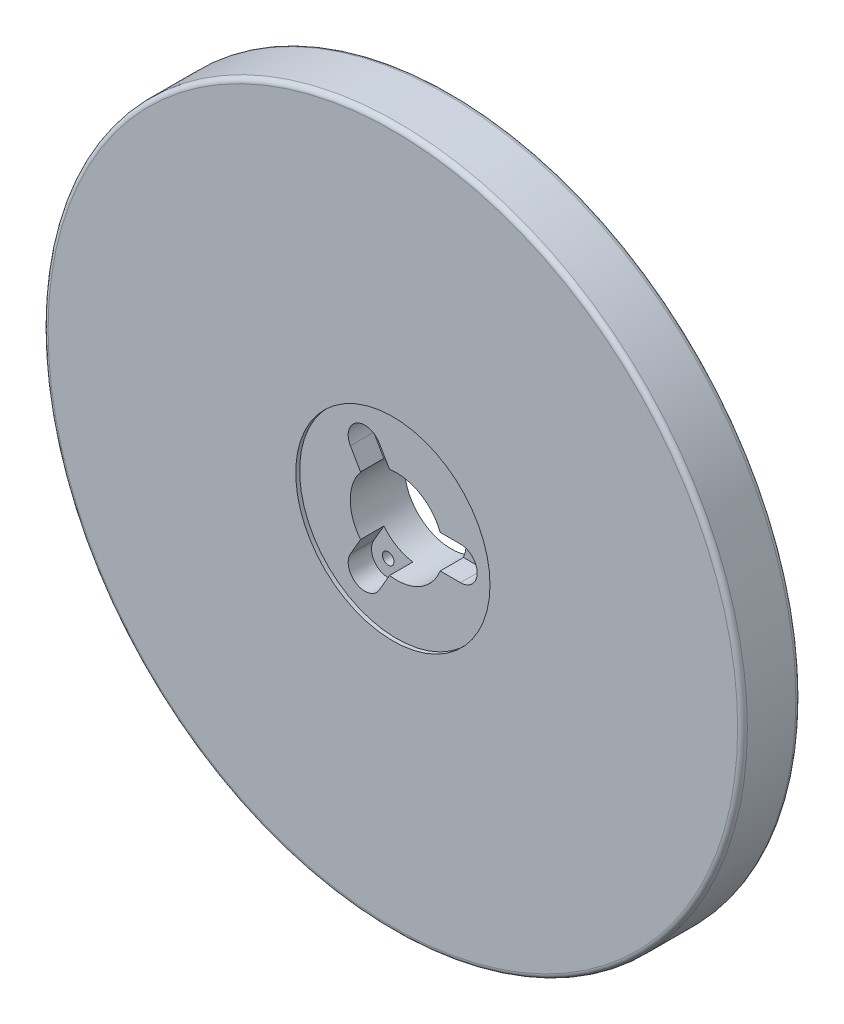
from build123d import *

# Parameters (mm, degrees)
SKETCH1_R          = 228.6
EXTRUDE1_DEPTH     = 19.05
SKETCH2_R          = 30.4165
CUT_EXTRUDE1_DEPTH = 326.526542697
FILLET1_R          = 3.175
FILLET2_R          = 3.175
SKETCH4_R          = 63.5
CUT_EXTRUDE3_DEPTH = 2.54
CUT_EXTRUDE6_START = -15.24
CUT_EXTRUDE6_DEPTH = 341.479040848
SKETCH11_R         = 9.525
CUT_EXTRUDE7_DEPTH = 12.7
SKETCH12_R         = 3.81
CUT_EXTRUDE8_DEPTH = 325.285491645
CIRPATTERN3_COUNT  = 3


with BuildPart() as part:
    # Sketch1 → Extrude1 (new, symmetric)
    with BuildSketch(Plane.XY):
        with Locations(Location((0, 0, 0), (0, 0, 180))):
            Circle(SKETCH1_R)
    extrude(amount=EXTRUDE1_DEPTH, both=True)

    # Sketch2 → Cut-Extrude1 (cut, through all)
    with BuildSketch(Plane.XY.offset(19.05)):
        Circle(SKETCH2_R)
    extrude(amount=-CUT_EXTRUDE1_DEPTH, mode=Mode.SUBTRACT)

    # Fillet1
    fillet1_edges = [part.edges().sort_by_distance(p)[0] for p in [
        (228.6, 0, 19.05),
    ]]
    fillet(fillet1_edges, radius=FILLET1_R)

    # Fillet2
    fillet2_edges = [part.edges().sort_by_distance(p)[0] for p in [
        (228.6, 0, -19.05),
    ]]
    fillet(fillet2_edges, radius=FILLET2_R)

    # Sketch4 → Cut-Extrude3 (cut)
    with BuildSketch(Plane.XY.offset(19.05)):
        Circle(SKETCH4_R)
    extrude(amount=-CUT_EXTRUDE3_DEPTH, mode=Mode.SUBTRACT)

    # Sketch10 → Cut-Extrude6 (cut)
    with BuildSketch(Plane.XY.offset(16.51).offset(CUT_EXTRUDE6_START)):
        with BuildLine():
            Line((41.656, -10.922), (28.387909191, -10.922))
            Line((28.387909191, -10.922), (28.387909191, 10.922))
            Line((28.387909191, 10.922), (41.656, 10.922))
            ThreePointArc((41.656, 10.922), (52.578, 0), (41.656, -10.922))
        make_face()
    cut_extrude6 = extrude(amount=CUT_EXTRUDE6_DEPTH, mode=Mode.SUBTRACT)

    # Sketch11 → Cut-Extrude7 (cut)
    with BuildSketch(Plane(origin=(0, 0, -19.05), x_dir=(-1, 0, 0), z_dir=(0, 0, -1))):
        with Locations((-41.656, 0)):
            Circle(SKETCH11_R)
    cut_extrude7 = extrude(amount=-CUT_EXTRUDE7_DEPTH, mode=Mode.SUBTRACT)

    # Sketch12 → Cut-Extrude8 (cut, through all)
    with BuildSketch(Plane(origin=(0, 0, -6.35), x_dir=(-1, 0, 0), z_dir=(0, 0, -1))):
        with Locations((-41.656, 0)):
            Circle(SKETCH12_R)
    cut_extrude8 = extrude(amount=-CUT_EXTRUDE8_DEPTH, mode=Mode.SUBTRACT)

    # CirPattern3: Cut-Extrude6, Cut-Extrude7, Cut-Extrude8 ×3 about axis
    cirpattern3_axis = Axis((0, 0, 0), (0, 0, 1))
    add([cut_extrude6.rotate(cirpattern3_axis, i * 360 / CIRPATTERN3_COUNT) for i in range(1, CIRPATTERN3_COUNT)], mode=Mode.SUBTRACT)
    add([cut_extrude7.rotate(cirpattern3_axis, i * 360 / CIRPATTERN3_COUNT) for i in range(1, CIRPATTERN3_COUNT)], mode=Mode.SUBTRACT)
    add([cut_extrude8.rotate(cirpattern3_axis, i * 360 / CIRPATTERN3_COUNT) for i in range(1, CIRPATTERN3_COUNT)], mode=Mode.SUBTRACT)


solid = part.part
